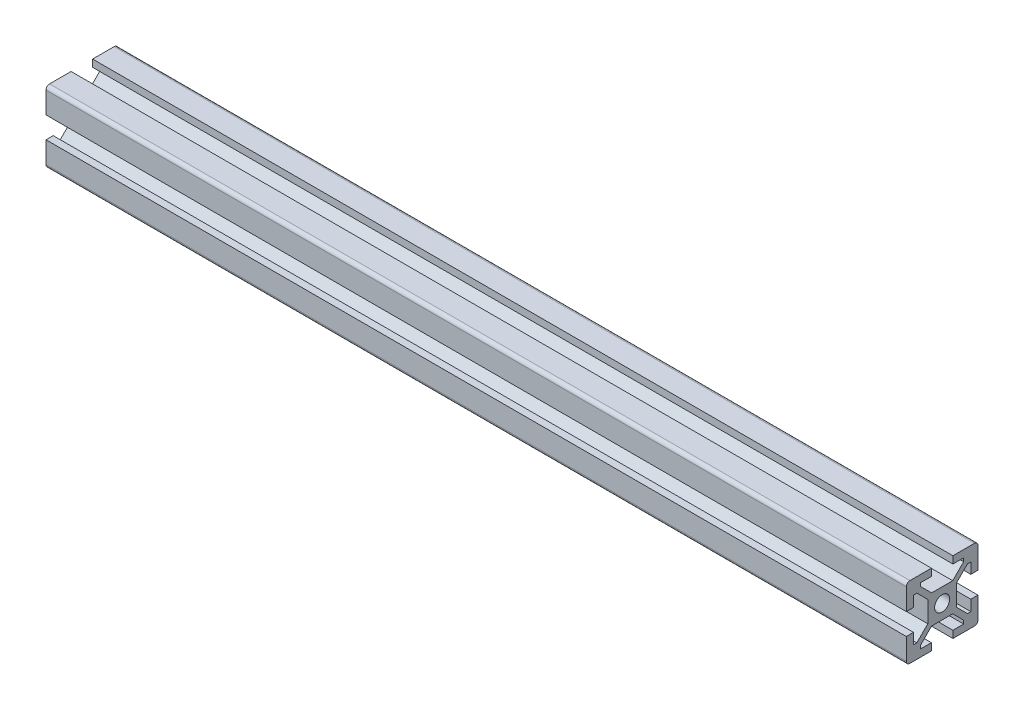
from build123d import *

# Parameters (mm, degrees)
SKETCH1_R           = 2.1
BOSS_EXTRUDE1_DEPTH = 240


with BuildPart() as part:
    # Sketch1 → Boss-Extrude1 (new body)
    with BuildSketch(Plane(origin=(0, 0, 0), x_dir=(0, 0, -1), z_dir=(1, 0, 0))):
        with BuildLine():
            Line((-10, 9), (-10, 3))
            Line((-10, 3), (-8, 3))
            Line((-8, 3), (-8, 6))
            Line((-8, 6), (-7.060660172, 6))
            Line((-7.060660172, 6), (-4, 2.939339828))
            Line((-4, 2.939339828), (-4, -2.939339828))
            Line((-4, -2.939339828), (-7.060660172, -6))
            Line((-7.060660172, -6), (-8, -6))
            Line((-8, -6), (-8, -3))
            Line((-8, -3), (-10, -3))
            Line((-10, -3), (-10, -9))
            ThreePointArc((-10, -9), (-9.707106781, -9.707106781), (-9, -10))
            Line((-9, -10), (-3, -10))
            Line((-3, -10), (-3, -8))
            Line((-3, -8), (-6, -8))
            Line((-6, -8), (-6, -7.060660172))
            Line((-6, -7.060660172), (-2.939339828, -4))
            Line((-2.939339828, -4), (2.939339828, -4))
            Line((2.939339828, -4), (6, -7.060660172))
            Line((6, -7.060660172), (6, -8))
            Line((6, -8), (3, -8))
            Line((3, -8), (3, -10))
            Line((3, -10), (9, -10))
            ThreePointArc((9, -10), (9.707106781, -9.707106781), (10, -9))
            Line((10, -9), (10, -3))
            Line((10, -3), (8, -3))
            Line((8, -3), (8, -6))
            Line((8, -6), (7.060660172, -6))
            Line((7.060660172, -6), (4, -2.939339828))
            Line((4, -2.939339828), (4, 2.939339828))
            Line((4, 2.939339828), (7.060660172, 6))
            Line((7.060660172, 6), (8, 6))
            Line((8, 6), (8, 3))
            Line((8, 3), (10, 3))
            Line((10, 3), (10, 9))
            ThreePointArc((10, 9), (9.707106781, 9.707106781), (9, 10))
            Line((9, 10), (3, 10))
            Line((3, 10), (3, 8))
            Line((3, 8), (6, 8))
            Line((6, 8), (6, 7.060660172))
            Line((6, 7.060660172), (2.939339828, 4))
            Line((2.939339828, 4), (-2.939339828, 4))
            Line((-2.939339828, 4), (-6, 7.060660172))
            Line((-6, 7.060660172), (-6, 8))
            Line((-6, 8), (-3, 8))
            Line((-3, 8), (-3, 10))
            Line((-3, 10), (-9, 10))
            ThreePointArc((-9, 10), (-9.707106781, 9.707106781), (-10, 9))
        make_face()
        Circle(SKETCH1_R, mode=Mode.SUBTRACT)
    extrude(amount=BOSS_EXTRUDE1_DEPTH)


solid = part.part
